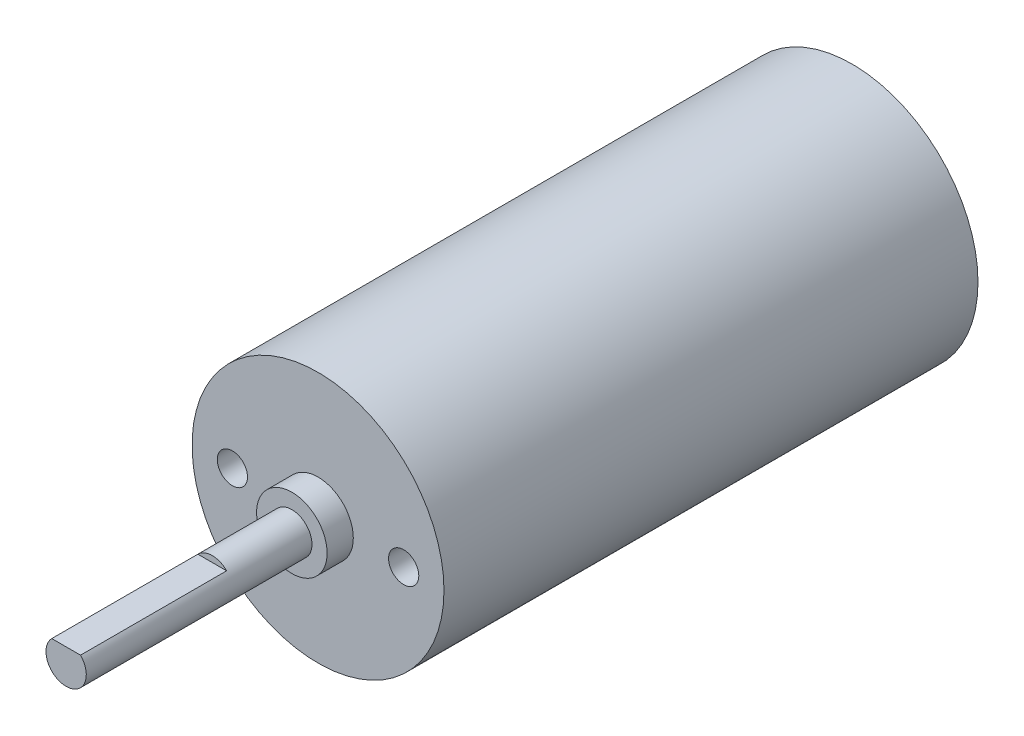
from build123d import *

# Parameters (mm, degrees)
SKETCH1_R                   = 12.5
BODY_DEPTH                  = 53
SKETCH2_R                   = 2
SHAFT_DEPTH                 = 25
SHAFT_FLAT_DEPTH            = 56.870385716
SHAFT_FLAT_DEPTH_BACK       = 56.870385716
SKETCH6_R                   = 3.5
SKETCH6_R_2                 = 2
BUSHING_DEPTH               = 2.6
MOUNTING_HOLE_PATTERN_COUNT = 2


with BuildPart() as part:
    # Sketch1 → body (new body)
    with BuildSketch(Plane.XY):
        Circle(SKETCH1_R)
    extrude(amount=-BODY_DEPTH)

    # Sketch2 → shaft (add)
    with BuildSketch(Plane.XY):
        Circle(SKETCH2_R)
    extrude(amount=SHAFT_DEPTH)

    # Sketch3 → shaft-flat (cut, two sides: drawn at the far end of the back side and taken through both)
    with BuildSketch(Plane(origin=(0, 0, 0), x_dir=(0, 0, -1), z_dir=(1, 0, 0)).offset(-SHAFT_FLAT_DEPTH_BACK)):
        Polygon((-193.457691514, 1.4), (-25, 1.4), (-10.5, 1.4), (-10.5, 2), (-10.5, 170.457691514), (-239.149794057, 417.907175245), (-422.107485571, 248.849483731), align=None)
    extrude(amount=SHAFT_FLAT_DEPTH + SHAFT_FLAT_DEPTH_BACK, mode=Mode.SUBTRACT)

    # Sketch6 → bushing (add)
    with BuildSketch(Plane.XY):
        Circle(SKETCH6_R)
        with Locations(Location((0, 0, 0), (0, 0, 135.572995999))):
            Circle(SKETCH6_R_2, mode=Mode.SUBTRACT)
    extrude(amount=BUSHING_DEPTH)

    # Sketch4 → tapped mounting hole (revolve, cut)
    with BuildSketch(Plane(origin=(8.5, 0, 0), x_dir=(0, -1, 0), z_dir=(1, 0, 0))):
        Polygon((0, 0), (0, 8.251075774), (1.25, 7.5), (1.25, 6), (1.5, 6), (1.5, 0), align=None)
    tapped_mounting_hole = revolve(axis=Axis((8.5, 0, 6.35), (0, 0, -1)), mode=Mode.SUBTRACT)

    # mounting hole pattern: tapped mounting hole ×2 about axis
    mounting_hole_pattern_axis = Axis((0, 0, 0), (0, 0, 1))
    for i in range(1, MOUNTING_HOLE_PATTERN_COUNT):
        add(tapped_mounting_hole.rotate(mounting_hole_pattern_axis, i * 360 / MOUNTING_HOLE_PATTERN_COUNT), mode=Mode.SUBTRACT)


solid = part.part
